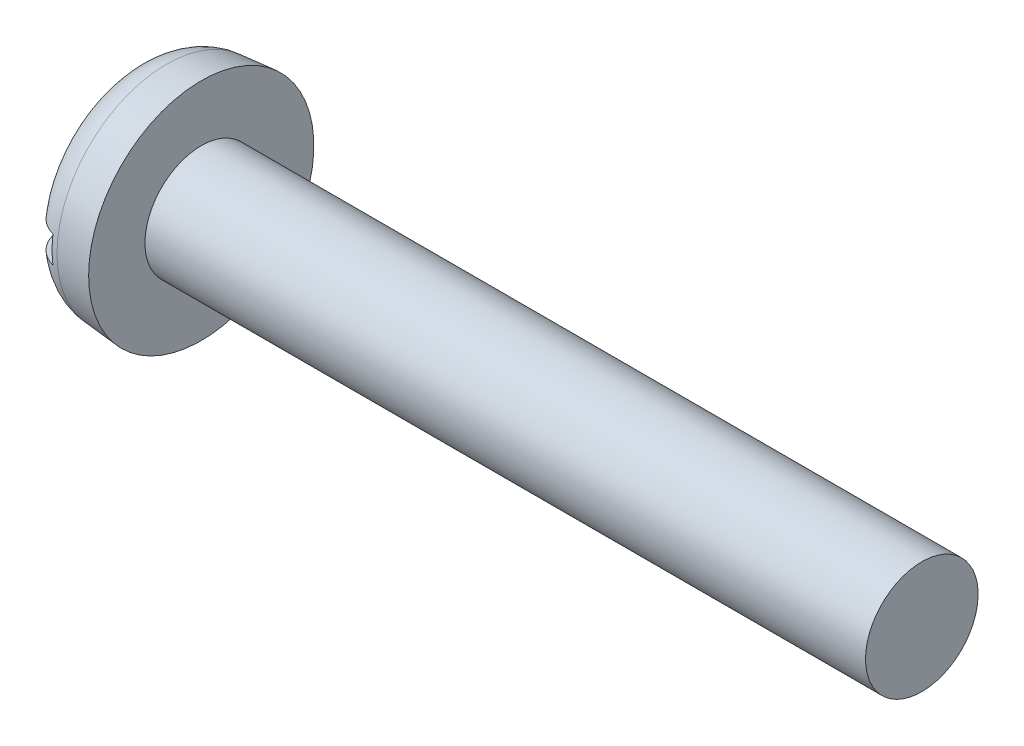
ISO-10303-21;
HEADER;
FILE_DESCRIPTION(('STEP AP214'),'2;1');
FILE_NAME('part.step','',(''),(''),'','','');
FILE_SCHEMA(('AUTOMOTIVE_DESIGN { 1 0 10303 214 1 1 1 1 }'));
ENDSEC;
DATA;
#1=APPLICATION_CONTEXT('core data for automotive mechanical design processes');
#2=APPLICATION_PROTOCOL_DEFINITION('international standard','automotive_design',2000,#1);
#3=PRODUCT_CONTEXT('',#1,'mechanical');
#4=PRODUCT('Part','Part','',(#3));
#5=PRODUCT_RELATED_PRODUCT_CATEGORY('part','',(#4));
#6=PRODUCT_DEFINITION_FORMATION('','',#4);
#7=PRODUCT_DEFINITION_CONTEXT('part definition',#1,'design');
#8=PRODUCT_DEFINITION('design','',#6,#7);
#9=PRODUCT_DEFINITION_SHAPE('','',#8);
#10=(LENGTH_UNIT() NAMED_UNIT(*) SI_UNIT(.MILLI.,.METRE.));
#11=(NAMED_UNIT(*) PLANE_ANGLE_UNIT() SI_UNIT($,.RADIAN.));
#12=(NAMED_UNIT(*) SI_UNIT($,.STERADIAN.) SOLID_ANGLE_UNIT());
#13=UNCERTAINTY_MEASURE_WITH_UNIT(LENGTH_MEASURE(1.E-05),#10,'distance_accuracy_value','');
#14=(GEOMETRIC_REPRESENTATION_CONTEXT(3) GLOBAL_UNCERTAINTY_ASSIGNED_CONTEXT((#13)) GLOBAL_UNIT_ASSIGNED_CONTEXT((#10,
#11,#12)) REPRESENTATION_CONTEXT('',''));
#15=CARTESIAN_POINT('',(0.,0.,0.));
#16=DIRECTION('',(0.,0.,1.));
#17=DIRECTION('',(1.,0.,0.));
#18=AXIS2_PLACEMENT_3D('',#15,#16,#17);
#19=CARTESIAN_POINT('',(0.,0.,0.));
#20=DIRECTION('',(-1.,0.,0.));
#21=DIRECTION('',(0.,0.,1.));
#22=AXIS2_PLACEMENT_3D('',#19,#20,#21);
#23=PLANE('',#22);
#24=DIRECTION('',(0.,0.,-1.));
#25=VECTOR('',#24,1.);
#26=CARTESIAN_POINT('',(0.,0.299999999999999,2.5));
#27=LINE('',#26,#25);
#28=CARTESIAN_POINT('',(0.,0.299999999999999,1.60795561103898));
#29=VERTEX_POINT('',#28);
#30=CARTESIAN_POINT('',(0.,0.299999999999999,-1.60795561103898));
#31=VERTEX_POINT('',#30);
#32=EDGE_CURVE('E86',#29,#31,#27,.T.);
#33=ORIENTED_EDGE('',*,*,#32,.F.);
#34=CARTESIAN_POINT('',(0.,0.,0.));
#35=DIRECTION('',(-1.,0.,0.));
#36=DIRECTION('',(0.,0.,1.));
#37=AXIS2_PLACEMENT_3D('',#34,#35,#36);
#38=CIRCLE('',#37,1.63570206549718);
#39=EDGE_CURVE('E92',#29,#31,#38,.T.);
#40=ORIENTED_EDGE('',*,*,#39,.T.);
#41=EDGE_LOOP('',(#33,#40));
#42=FACE_BOUND('',#41,.T.);
#43=ADVANCED_FACE('F33',(#42),#23,.T.);
#44=CARTESIAN_POINT('',(-25.4,0.,0.));
#45=DIRECTION('',(-1.,0.,0.));
#46=DIRECTION('',(0.,0.,1.));
#47=AXIS2_PLACEMENT_3D('',#44,#45,#46);
#48=CYLINDRICAL_SURFACE('',#47,1.25);
#49=CARTESIAN_POINT('',(17.5,0.,0.));
#50=DIRECTION('',(-1.,0.,0.));
#51=DIRECTION('',(0.,0.,1.));
#52=AXIS2_PLACEMENT_3D('',#49,#50,#51);
#53=CIRCLE('',#52,1.25);
#54=CARTESIAN_POINT('',(17.5,0.,1.25));
#55=VERTEX_POINT('',#54);
#56=EDGE_CURVE('E93',#55,#55,#53,.T.);
#57=ORIENTED_EDGE('',*,*,#56,.T.);
#58=EDGE_LOOP('',(#57));
#59=FACE_BOUND('',#58,.T.);
#60=CARTESIAN_POINT('',(1.5,0.,0.));
#61=DIRECTION('',(-1.,0.,0.));
#62=DIRECTION('',(0.,0.,1.));
#63=AXIS2_PLACEMENT_3D('',#60,#61,#62);
#64=CIRCLE('',#63,1.25);
#65=CARTESIAN_POINT('',(1.5,0.,1.25));
#66=VERTEX_POINT('',#65);
#67=EDGE_CURVE('E150',#66,#66,#64,.T.);
#68=ORIENTED_EDGE('',*,*,#67,.F.);
#69=EDGE_LOOP('',(#68));
#70=FACE_BOUND('',#69,.T.);
#71=ADVANCED_FACE('F138',(#59,#70),#48,.T.);
#72=CARTESIAN_POINT('',(17.5,1.25,0.));
#73=DIRECTION('',(1.,0.,0.));
#74=DIRECTION('',(0.,0.,-1.));
#75=AXIS2_PLACEMENT_3D('',#72,#73,#74);
#76=PLANE('',#75);
#77=ORIENTED_EDGE('',*,*,#56,.F.);
#78=EDGE_LOOP('',(#77));
#79=FACE_BOUND('',#78,.T.);
#80=ADVANCED_FACE('F136',(#79),#76,.T.);
#81=DIRECTION('',(0.,0.,1.));
#82=VECTOR('',#81,1.);
#83=CARTESIAN_POINT('',(0.,-0.299999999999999,-2.5));
#84=LINE('',#83,#82);
#85=CARTESIAN_POINT('',(0.,-0.3,-1.60795561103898));
#86=VERTEX_POINT('',#85);
#87=CARTESIAN_POINT('',(0.,-0.3,1.60795561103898));
#88=VERTEX_POINT('',#87);
#89=EDGE_CURVE('E77',#86,#88,#84,.T.);
#90=ORIENTED_EDGE('',*,*,#89,.F.);
#91=EDGE_CURVE('E84',#86,#88,#38,.T.);
#92=ORIENTED_EDGE('',*,*,#91,.T.);
#93=EDGE_LOOP('',(#90,#92));
#94=FACE_BOUND('',#93,.T.);
#95=ADVANCED_FACE('F83',(#94),#23,.T.);
#96=CARTESIAN_POINT('',(0.,0.,0.));
#97=DIRECTION('',(1.,0.,0.));
#98=DIRECTION('',(0.,0.,-1.));
#99=AXIS2_PLACEMENT_3D('',#96,#97,#98);
#100=CONICAL_SURFACE('',#99,2.36876700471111,0.0872664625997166);
#101=CARTESIAN_POINT('',(0.730275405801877,0.,0.));
#102=DIRECTION('',(-1.,0.,0.));
#103=DIRECTION('',(0.,0.,1.));
#104=AXIS2_PLACEMENT_3D('',#101,#102,#103);
#105=CIRCLE('',#104,2.43265782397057);
#106=CARTESIAN_POINT('',(0.730275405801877,0.,2.43265782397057));
#107=VERTEX_POINT('',#106);
#108=EDGE_CURVE('E96',#107,#107,#105,.F.);
#109=ORIENTED_EDGE('',*,*,#108,.T.);
#110=EDGE_LOOP('',(#109));
#111=FACE_BOUND('',#110,.T.);
#112=CARTESIAN_POINT('',(1.5,0.,0.));
#113=DIRECTION('',(-1.,0.,0.));
#114=DIRECTION('',(0.,0.,1.));
#115=AXIS2_PLACEMENT_3D('',#112,#113,#114);
#116=CIRCLE('',#115,2.5);
#117=CARTESIAN_POINT('',(1.5,0.,2.5));
#118=VERTEX_POINT('',#117);
#119=EDGE_CURVE('E98',#118,#118,#116,.T.);
#120=ORIENTED_EDGE('',*,*,#119,.T.);
#121=EDGE_LOOP('',(#120));
#122=FACE_BOUND('',#121,.T.);
#123=ADVANCED_FACE('F129',(#111,#122),#100,.T.);
#124=CARTESIAN_POINT('',(1.5,1.25,0.));
#125=DIRECTION('',(-1.,0.,0.));
#126=DIRECTION('',(0.,0.,1.));
#127=AXIS2_PLACEMENT_3D('',#124,#125,#126);
#128=PLANE('',#127);
#129=ORIENTED_EDGE('',*,*,#119,.F.);
#130=EDGE_LOOP('',(#129));
#131=FACE_BOUND('',#130,.T.);
#132=ORIENTED_EDGE('',*,*,#67,.T.);
#133=EDGE_LOOP('',(#132));
#134=FACE_BOUND('',#133,.T.);
#135=ADVANCED_FACE('F125',(#131,#134),#128,.F.);
#136=CARTESIAN_POINT('',(0.8,0.,0.));
#137=DIRECTION('',(-1.,0.,0.));
#138=DIRECTION('',(0.,0.,1.));
#139=AXIS2_PLACEMENT_3D('',#136,#137,#138);
#140=TOROIDAL_SURFACE('',#139,1.63570206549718,0.8);
#141=CARTESIAN_POINT('',(0.241553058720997,0.299999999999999,-2.18806414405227));
#142=CARTESIAN_POINT('',(0.273486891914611,0.299999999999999,-2.219484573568));
#143=CARTESIAN_POINT('',(0.308083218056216,0.299999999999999,-2.2482435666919));
#144=CARTESIAN_POINT('',(0.381637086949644,0.299999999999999,-2.2995751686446));
#145=CARTESIAN_POINT('',(0.420599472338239,0.299999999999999,-2.32214081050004));
#146=CARTESIAN_POINT('',(0.501759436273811,0.299999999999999,-2.360393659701));
#147=CARTESIAN_POINT('',(0.543956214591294,0.299999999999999,-2.37608256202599));
#148=CARTESIAN_POINT('',(0.630379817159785,0.299999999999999,-2.40012145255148));
#149=CARTESIAN_POINT('',(0.674606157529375,0.299999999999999,-2.40847318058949));
#150=CARTESIAN_POINT('',(0.763687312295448,0.299999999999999,-2.41758391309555));
#151=CARTESIAN_POINT('',(0.808539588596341,0.299999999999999,-2.41836773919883));
#152=CARTESIAN_POINT('',(0.897738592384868,0.299999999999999,-2.41238411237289));
#153=CARTESIAN_POINT('',(0.942085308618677,0.299999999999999,-2.40561649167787));
#154=CARTESIAN_POINT('',(1.02895845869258,0.299999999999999,-2.38474089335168));
#155=CARTESIAN_POINT('',(1.07148703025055,0.299999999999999,-2.37064180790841));
#156=CARTESIAN_POINT('',(1.15358098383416,0.299999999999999,-2.33551973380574));
#157=CARTESIAN_POINT('',(1.19314635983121,0.299999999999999,-2.31449673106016));
#158=CARTESIAN_POINT('',(1.26829517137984,0.299999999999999,-2.26608024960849));
#159=CARTESIAN_POINT('',(1.30386914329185,0.299999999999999,-2.23867208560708));
#160=CARTESIAN_POINT('',(1.36994420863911,0.299999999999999,-2.17830511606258));
#161=CARTESIAN_POINT('',(1.40044520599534,0.299999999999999,-2.14534620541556));
#162=CARTESIAN_POINT('',(1.45571441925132,0.299999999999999,-2.07460780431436));
#163=CARTESIAN_POINT('',(1.48044693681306,0.299999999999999,-2.03680042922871));
#164=CARTESIAN_POINT('',(1.5232858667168,0.299999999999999,-1.95760333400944));
#165=CARTESIAN_POINT('',(1.54139201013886,0.299999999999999,-1.9162134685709));
#166=CARTESIAN_POINT('',(1.57067208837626,0.299999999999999,-1.83058118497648));
#167=CARTESIAN_POINT('',(1.58177374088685,0.299999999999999,-1.7863140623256));
#168=CARTESIAN_POINT('',(1.59650148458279,0.299999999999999,-1.69655495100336));
#169=CARTESIAN_POINT('',(1.60012708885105,0.299999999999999,-1.65106288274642));
#170=CARTESIAN_POINT('',(1.59986422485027,0.299999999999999,-1.55944552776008));
#171=CARTESIAN_POINT('',(1.59586670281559,0.299999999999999,-1.51332056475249));
#172=CARTESIAN_POINT('',(1.58031748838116,0.299999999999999,-1.42236288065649));
#173=CARTESIAN_POINT('',(1.56876510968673,0.299999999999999,-1.37753027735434));
#174=CARTESIAN_POINT('',(1.53821798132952,0.299999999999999,-1.28962965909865));
#175=CARTESIAN_POINT('',(1.51910141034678,0.299999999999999,-1.24660396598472));
#176=CARTESIAN_POINT('',(1.4739944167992,0.299999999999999,-1.16431539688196));
#177=CARTESIAN_POINT('',(1.44800306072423,0.299999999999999,-1.12505303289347));
#178=CARTESIAN_POINT('',(1.38953237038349,0.299999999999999,-1.0509944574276));
#179=CARTESIAN_POINT('',(1.35698561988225,0.299999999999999,-1.01625139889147));
#180=CARTESIAN_POINT('',(1.28643964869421,0.299999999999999,-0.952810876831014));
#181=CARTESIAN_POINT('',(1.24844019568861,0.299999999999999,-0.924113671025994));
#182=CARTESIAN_POINT('',(1.16862359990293,0.299999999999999,-0.874188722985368));
#183=CARTESIAN_POINT('',(1.12687482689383,0.299999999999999,-0.852852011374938));
#184=CARTESIAN_POINT('',(1.04024465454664,0.299999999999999,-0.817966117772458));
#185=CARTESIAN_POINT('',(0.995364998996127,0.299999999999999,-0.804412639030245));
#186=CARTESIAN_POINT('',(0.906428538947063,0.299999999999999,-0.786315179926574));
#187=CARTESIAN_POINT('',(0.862465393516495,0.299999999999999,-0.781310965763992));
#188=CARTESIAN_POINT('',(0.774351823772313,0.299999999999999,-0.779140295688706));
#189=CARTESIAN_POINT('',(0.730201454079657,0.299999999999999,-0.78197169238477));
#190=CARTESIAN_POINT('',(0.645014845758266,0.299999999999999,-0.795014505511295));
#191=CARTESIAN_POINT('',(0.603927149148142,0.299999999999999,-0.804894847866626));
#192=CARTESIAN_POINT('',(0.523912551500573,0.299999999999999,-0.831215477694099));
#193=CARTESIAN_POINT('',(0.484986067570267,0.299999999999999,-0.847657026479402));
#194=CARTESIAN_POINT('',(0.409119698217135,0.299999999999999,-0.887046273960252));
#195=CARTESIAN_POINT('',(0.372272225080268,0.299999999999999,-0.910171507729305));
#196=CARTESIAN_POINT('',(0.302689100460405,0.299999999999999,-0.961944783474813));
#197=CARTESIAN_POINT('',(0.269954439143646,0.299999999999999,-0.990594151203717));
#198=CARTESIAN_POINT('',(0.207500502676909,0.299999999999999,-1.0544791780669));
#199=CARTESIAN_POINT('',(0.178079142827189,0.299999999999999,-1.09000648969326));
#200=CARTESIAN_POINT('',(0.125406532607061,0.299999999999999,-1.16537577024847));
#201=CARTESIAN_POINT('',(0.102156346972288,0.299999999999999,-1.20521848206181));
#202=CARTESIAN_POINT('',(0.0618533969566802,0.299999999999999,-1.28940055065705));
#203=CARTESIAN_POINT('',(0.0450063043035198,0.299999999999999,-1.33383862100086));
#204=CARTESIAN_POINT('',(0.0190387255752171,0.299999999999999,-1.42491821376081));
#205=CARTESIAN_POINT('',(0.00991800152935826,0.299999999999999,-1.47155966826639));
#206=CARTESIAN_POINT('',(-0.000253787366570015,0.299999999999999,-1.56555416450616));
#207=CARTESIAN_POINT('',(-0.00133269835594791,0.299999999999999,-1.61290418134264));
#208=CARTESIAN_POINT('',(0.00461213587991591,0.299999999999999,-1.70710757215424));
#209=CARTESIAN_POINT('',(0.0116373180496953,0.299999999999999,-1.7539608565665));
#210=CARTESIAN_POINT('',(0.0334759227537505,0.299999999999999,-1.84503548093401));
#211=CARTESIAN_POINT('',(0.0481656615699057,0.299999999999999,-1.88928654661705));
#212=CARTESIAN_POINT('',(0.0848786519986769,0.299999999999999,-1.97459063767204));
#213=CARTESIAN_POINT('',(0.106892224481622,0.299999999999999,-2.01564779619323));
#214=CARTESIAN_POINT('',(0.148004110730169,0.299999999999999,-2.07862726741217));
#215=CARTESIAN_POINT('',(0.165054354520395,0.299999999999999,-2.10191210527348));
#216=CARTESIAN_POINT('',(0.201553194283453,0.299999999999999,-2.14652009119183));
#217=CARTESIAN_POINT('',(0.221001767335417,0.299999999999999,-2.16784325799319));
#218=CARTESIAN_POINT('',(0.241553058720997,0.299999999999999,-2.18806414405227));
#219=B_SPLINE_CURVE_WITH_KNOTS('',3,(#141,#142,#143,#144,#145,#146,#147,#148,#149,#150,#151,
#152,#153,#154,#155,#156,#157,#158,#159,#160,#161,#162,#163,#164,#165,#166,#167,#168,#169,#170,
#171,#172,#173,#174,#175,#176,#177,#178,#179,#180,#181,#182,#183,#184,#185,#186,#187,#188,#189,
#190,#191,#192,#193,#194,#195,#196,#197,#198,#199,#200,#201,#202,#203,#204,#205,#206,#207,#208,
#209,#210,#211,#212,#213,#214,#215,#216,#217,#218),.UNSPECIFIED.,.T.,.F.,(4,2,2,2,2,2,2,2,2,2,2,
2,2,2,2,2,2,2,2,2,2,2,2,2,2,2,2,2,2,2,2,2,2,2,2,2,2,2,4),(0.,0.134294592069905,
0.268739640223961,0.403151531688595,0.53753154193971,0.671470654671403,0.805412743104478,
0.939192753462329,1.07297303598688,1.20706409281,1.34115768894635,1.4760603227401,
1.610968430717,1.74724687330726,1.88353419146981,2.02178582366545,2.16005001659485,
2.3006380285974,2.44124514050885,2.58337977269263,2.72552046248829,2.86545608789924,
3.0053143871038,3.13737410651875,3.26939763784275,3.39559705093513,3.5218207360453,
3.6517660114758,3.78174251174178,3.91950163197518,4.05728450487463,4.19917951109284,
4.34107014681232,4.48246923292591,4.62389339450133,4.76310290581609,4.90212916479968,
4.98855642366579,5.07498285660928),.UNSPECIFIED.);
#220=CARTESIAN_POINT('',(0.6,0.299999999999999,-2.39155597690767));
#221=VERTEX_POINT('',#220);
#222=EDGE_CURVE('E11',#31,#221,#219,.T.);
#223=ORIENTED_EDGE('',*,*,#222,.F.);
#224=ORIENTED_EDGE('',*,*,#39,.F.);
#225=CARTESIAN_POINT('',(0.325582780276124,0.299999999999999,0.945080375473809));
#226=CARTESIAN_POINT('',(0.360465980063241,0.299999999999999,0.918126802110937));
#227=CARTESIAN_POINT('',(0.39753706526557,0.299999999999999,0.89396794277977));
#228=CARTESIAN_POINT('',(0.475178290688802,0.299999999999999,0.852069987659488));
#229=CARTESIAN_POINT('',(0.515750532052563,0.299999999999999,0.834334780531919));
#230=CARTESIAN_POINT('',(0.599430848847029,0.299999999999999,0.806000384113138));
#231=CARTESIAN_POINT('',(0.642544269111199,0.299999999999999,0.795416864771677));
#232=CARTESIAN_POINT('',(0.729949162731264,0.299999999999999,0.781986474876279));
#233=CARTESIAN_POINT('',(0.774240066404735,0.299999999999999,0.779135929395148));
#234=CARTESIAN_POINT('',(0.860900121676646,0.299999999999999,0.781273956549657));
#235=CARTESIAN_POINT('',(0.903277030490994,0.299999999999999,0.785962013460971));
#236=CARTESIAN_POINT('',(0.98664237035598,0.299999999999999,0.802380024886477));
#237=CARTESIAN_POINT('',(1.02763059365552,0.299999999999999,0.814111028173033));
#238=CARTESIAN_POINT('',(1.10721823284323,0.299999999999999,0.844123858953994));
#239=CARTESIAN_POINT('',(1.1458124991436,0.299999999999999,0.862419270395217));
#240=CARTESIAN_POINT('',(1.21961995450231,0.299999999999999,0.904880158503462));
#241=CARTESIAN_POINT('',(1.25483237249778,0.299999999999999,0.929046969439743));
#242=CARTESIAN_POINT('',(1.32303560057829,0.299999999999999,0.984072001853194));
#243=CARTESIAN_POINT('',(1.35577888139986,0.299999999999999,1.01523716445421));
#244=CARTESIAN_POINT('',(1.41584692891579,0.299999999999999,1.08241378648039));
#245=CARTESIAN_POINT('',(1.44317052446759,0.299999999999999,1.11842629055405));
#246=CARTESIAN_POINT('',(1.49280325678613,0.299999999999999,1.19602852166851));
#247=CARTESIAN_POINT('',(1.51483781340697,0.299999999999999,1.23779426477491));
#248=CARTESIAN_POINT('',(1.55163905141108,0.299999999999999,1.32441622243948));
#249=CARTESIAN_POINT('',(1.5664052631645,0.299999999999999,1.36927263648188));
#250=CARTESIAN_POINT('',(1.58827918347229,0.299999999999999,1.46113964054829));
#251=CARTESIAN_POINT('',(1.59533472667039,0.299999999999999,1.50816268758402));
#252=CARTESIAN_POINT('',(1.6013346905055,0.299999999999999,1.60272526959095));
#253=CARTESIAN_POINT('',(1.60027956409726,0.299999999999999,1.65026477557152));
#254=CARTESIAN_POINT('',(1.59008797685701,0.299999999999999,1.74381783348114));
#255=CARTESIAN_POINT('',(1.58106139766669,0.299999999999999,1.78984333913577));
#256=CARTESIAN_POINT('',(1.55527524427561,0.299999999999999,1.87967577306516));
#257=CARTESIAN_POINT('',(1.53851634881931,0.299999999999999,1.92348289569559));
#258=CARTESIAN_POINT('',(1.49805220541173,0.299999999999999,2.00685269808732));
#259=CARTESIAN_POINT('',(1.47446834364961,0.299999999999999,2.04647430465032));
#260=CARTESIAN_POINT('',(1.42089792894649,0.299999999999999,2.1211234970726));
#261=CARTESIAN_POINT('',(1.3909118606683,0.299999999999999,2.15615143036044));
#262=CARTESIAN_POINT('',(1.32582862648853,0.299999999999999,2.2201279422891));
#263=CARTESIAN_POINT('',(1.29080536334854,0.299999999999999,2.24915172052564));
#264=CARTESIAN_POINT('',(1.21634648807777,0.299999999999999,2.30084404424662));
#265=CARTESIAN_POINT('',(1.17691110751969,0.299999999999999,2.32351292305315));
#266=CARTESIAN_POINT('',(1.09512866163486,0.299999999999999,2.36164850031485));
#267=CARTESIAN_POINT('',(1.05281068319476,0.299999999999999,2.3771775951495));
#268=CARTESIAN_POINT('',(0.96616121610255,0.299999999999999,2.40087211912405));
#269=CARTESIAN_POINT('',(0.921829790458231,0.299999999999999,2.40903777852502));
#270=CARTESIAN_POINT('',(0.832640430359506,0.299999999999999,2.41774335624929));
#271=CARTESIAN_POINT('',(0.787786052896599,0.299999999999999,2.41831975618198));
#272=CARTESIAN_POINT('',(0.698619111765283,0.299999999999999,2.41192430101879));
#273=CARTESIAN_POINT('',(0.654306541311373,0.299999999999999,2.40495254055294));
#274=CARTESIAN_POINT('',(0.567532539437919,0.299999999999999,2.38367749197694));
#275=CARTESIAN_POINT('',(0.525069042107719,0.299999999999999,2.36938262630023));
#276=CARTESIAN_POINT('',(0.443136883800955,0.299999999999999,2.33388299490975));
#277=CARTESIAN_POINT('',(0.403668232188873,0.299999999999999,2.31267820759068));
#278=CARTESIAN_POINT('',(0.328740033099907,0.299999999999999,2.26391578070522));
#279=CARTESIAN_POINT('',(0.293290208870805,0.299999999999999,2.2363432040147));
#280=CARTESIAN_POINT('',(0.227488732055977,0.299999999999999,2.17567064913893));
#281=CARTESIAN_POINT('',(0.197137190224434,0.299999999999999,2.14257055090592));
#282=CARTESIAN_POINT('',(0.142187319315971,0.299999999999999,2.07157434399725));
#283=CARTESIAN_POINT('',(0.117625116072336,0.299999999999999,2.03365028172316));
#284=CARTESIAN_POINT('',(0.075143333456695,0.299999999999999,1.95424980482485));
#285=CARTESIAN_POINT('',(0.05722404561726,0.299999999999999,1.91277323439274));
#286=CARTESIAN_POINT('',(0.0283296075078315,0.299999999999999,1.82699572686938));
#287=CARTESIAN_POINT('',(0.0174274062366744,0.299999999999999,1.78267022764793));
#288=CARTESIAN_POINT('',(0.00310551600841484,0.299999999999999,1.69282988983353));
#289=CARTESIAN_POINT('',(-0.000313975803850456,0.299999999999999,1.64731501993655));
#290=CARTESIAN_POINT('',(0.00036415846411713,0.299999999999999,1.55568808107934));
#291=CARTESIAN_POINT('',(0.00457053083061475,0.299999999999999,1.50957683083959));
#292=CARTESIAN_POINT('',(0.0205339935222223,0.299999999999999,1.41866966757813));
#293=CARTESIAN_POINT('',(0.0322934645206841,0.299999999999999,1.37387417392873));
#294=CARTESIAN_POINT('',(0.0632540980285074,0.299999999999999,1.2860673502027));
#295=CARTESIAN_POINT('',(0.0825799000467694,0.299999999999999,1.24310001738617));
#296=CARTESIAN_POINT('',(0.128084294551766,0.299999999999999,1.16099749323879));
#297=CARTESIAN_POINT('',(0.154256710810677,0.299999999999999,1.12185889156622));
#298=CARTESIAN_POINT('',(0.204267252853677,0.299999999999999,1.05910852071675));
#299=CARTESIAN_POINT('',(0.226595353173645,0.299999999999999,1.03427766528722));
#300=CARTESIAN_POINT('',(0.274059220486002,0.299999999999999,0.987458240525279));
#301=CARTESIAN_POINT('',(0.299195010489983,0.299999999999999,0.965469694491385));
#302=CARTESIAN_POINT('',(0.325582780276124,0.299999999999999,0.945080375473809));
#303=B_SPLINE_CURVE_WITH_KNOTS('',3,(#225,#226,#227,#228,#229,#230,#231,#232,#233,#234,#235,
#236,#237,#238,#239,#240,#241,#242,#243,#244,#245,#246,#247,#248,#249,#250,#251,#252,#253,#254,
#255,#256,#257,#258,#259,#260,#261,#262,#263,#264,#265,#266,#267,#268,#269,#270,#271,#272,#273,
#274,#275,#276,#277,#278,#279,#280,#281,#282,#283,#284,#285,#286,#287,#288,#289,#290,#291,#292,
#293,#294,#295,#296,#297,#298,#299,#300,#301,#302),.UNSPECIFIED.,.T.,.F.,(4,2,2,2,2,2,2,2,2,2,2,
2,2,2,2,2,2,2,2,2,2,2,2,2,2,2,2,2,2,2,2,2,2,2,2,2,2,2,4),(0.,0.132137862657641,
0.264355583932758,0.396862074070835,0.529305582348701,0.656598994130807,0.783911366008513,
0.911488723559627,1.03909510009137,1.17410712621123,1.30914829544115,1.45015029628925,
1.59116140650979,1.73312071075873,1.87507208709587,2.01509676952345,2.15510916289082,
2.29277014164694,2.43042070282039,2.56622605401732,2.70202428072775,2.83661205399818,
2.97119561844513,3.10513200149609,3.23906670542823,3.37284771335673,3.50662913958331,
3.64072762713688,3.77482902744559,3.90974629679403,4.04466948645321,4.18097358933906,
4.31728128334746,4.45554806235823,4.59385844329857,4.73455014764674,4.87511537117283,
4.97507165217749,5.07502875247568),.UNSPECIFIED.);
#304=CARTESIAN_POINT('',(0.6,0.299999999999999,2.39155597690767));
#305=VERTEX_POINT('',#304);
#306=EDGE_CURVE('E110',#305,#29,#303,.T.);
#307=ORIENTED_EDGE('',*,*,#306,.F.);
#308=CARTESIAN_POINT('',(0.6,0.,0.));
#309=DIRECTION('',(-1.,0.,0.));
#310=DIRECTION('',(0.,0.,1.));
#311=AXIS2_PLACEMENT_3D('',#308,#309,#310);
#312=CIRCLE('',#311,2.41029873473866);
#313=CARTESIAN_POINT('',(0.6,-0.3,2.39155597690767));
#314=VERTEX_POINT('',#313);
#315=EDGE_CURVE('E104',#305,#314,#312,.F.);
#316=ORIENTED_EDGE('',*,*,#315,.T.);
#317=CARTESIAN_POINT('',(0.325582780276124,-0.3,0.945080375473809));
#318=CARTESIAN_POINT('',(0.288319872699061,-0.3,0.973876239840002));
#319=CARTESIAN_POINT('',(0.253501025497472,-0.3,1.00590457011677));
#320=CARTESIAN_POINT('',(0.189696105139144,-0.3,1.07538681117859));
#321=CARTESIAN_POINT('',(0.160720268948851,-0.3,1.11285004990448));
#322=CARTESIAN_POINT('',(0.109449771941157,-0.3,1.19204724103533));
#323=CARTESIAN_POINT('',(0.0871478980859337,-0.3,1.23377651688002));
#324=CARTESIAN_POINT('',(0.0498324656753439,-0.3,1.32035492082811));
#325=CARTESIAN_POINT('',(0.0348158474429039,-0.3,1.36520273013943));
#326=CARTESIAN_POINT('',(0.0124672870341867,-0.3,1.45703060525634));
#327=CARTESIAN_POINT('',(0.00517650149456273,-0.3,1.5040207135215));
#328=CARTESIAN_POINT('',(-0.00129803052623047,-0.3,1.59856214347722));
#329=CARTESIAN_POINT('',(-0.000481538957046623,-0.3,1.64611348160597));
#330=CARTESIAN_POINT('',(0.00924123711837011,-0.3,1.73973571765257));
#331=CARTESIAN_POINT('',(0.0180384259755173,-0.3,1.78581792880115));
#332=CARTESIAN_POINT('',(0.0433789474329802,-0.3,1.87580166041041));
#333=CARTESIAN_POINT('',(0.0599215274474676,-0.3,1.91970339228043));
#334=CARTESIAN_POINT('',(0.0999760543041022,-0.3,2.00329545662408));
#335=CARTESIAN_POINT('',(0.123366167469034,-0.3,2.04304417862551));
#336=CARTESIAN_POINT('',(0.17657394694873,-0.3,2.11797834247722));
#337=CARTESIAN_POINT('',(0.206391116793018,-0.3,2.15316413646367));
#338=CARTESIAN_POINT('',(0.271166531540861,-0.3,2.21747794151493));
#339=CARTESIAN_POINT('',(0.306050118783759,-0.3,2.24668116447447));
#340=CARTESIAN_POINT('',(0.380262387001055,-0.3,2.29875303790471));
#341=CARTESIAN_POINT('',(0.419590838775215,-0.3,2.32162201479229));
#342=CARTESIAN_POINT('',(0.50119340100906,-0.3,2.36016923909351));
#343=CARTESIAN_POINT('',(0.543437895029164,-0.3,2.37591020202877));
#344=CARTESIAN_POINT('',(0.62997726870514,-0.3,2.40003737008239));
#345=CARTESIAN_POINT('',(0.674272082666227,-0.3,2.40842381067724));
#346=CARTESIAN_POINT('',(0.763423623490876,-0.3,2.41757198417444));
#347=CARTESIAN_POINT('',(0.80827656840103,-0.3,2.41837061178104));
#348=CARTESIAN_POINT('',(0.897477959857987,-0.3,2.412416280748));
#349=CARTESIAN_POINT('',(0.941826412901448,-0.3,2.4056634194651));
#350=CARTESIAN_POINT('',(1.02870592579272,-0.3,2.38481675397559));
#351=CARTESIAN_POINT('',(1.07123910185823,-0.3,2.3707317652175));
#352=CARTESIAN_POINT('',(1.15334462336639,-0.3,2.33563687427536));
#353=CARTESIAN_POINT('',(1.19291695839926,-0.3,2.3146269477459));
#354=CARTESIAN_POINT('',(1.26808156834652,-0.3,2.26623538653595));
#355=CARTESIAN_POINT('',(1.30366440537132,-0.3,2.23883909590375));
#356=CARTESIAN_POINT('',(1.36975910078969,-0.3,2.17849415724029));
#357=CARTESIAN_POINT('',(1.40027085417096,-0.3,2.14554539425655));
#358=CARTESIAN_POINT('',(1.45556302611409,-0.3,2.07482553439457));
#359=CARTESIAN_POINT('',(1.48030778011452,-0.3,2.0370265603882));
#360=CARTESIAN_POINT('',(1.52317234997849,-0.3,1.95784414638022));
#361=CARTESIAN_POINT('',(1.54129190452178,-0.3,1.91646056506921));
#362=CARTESIAN_POINT('',(1.570599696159,-0.3,1.8308387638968));
#363=CARTESIAN_POINT('',(1.58171568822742,-0.3,1.7865758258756));
#364=CARTESIAN_POINT('',(1.59647258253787,-0.3,1.69682261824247));
#365=CARTESIAN_POINT('',(1.60011299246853,-0.3,1.65133226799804));
#366=CARTESIAN_POINT('',(1.59987999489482,-0.3,1.55971607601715));
#367=CARTESIAN_POINT('',(1.59589756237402,-0.3,1.51359052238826));
#368=CARTESIAN_POINT('',(1.58037822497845,-0.3,1.4226292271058));
#369=CARTESIAN_POINT('',(1.56884064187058,-0.3,1.37779360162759));
#370=CARTESIAN_POINT('',(1.53832268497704,-0.3,1.28988447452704));
#371=CARTESIAN_POINT('',(1.51922047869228,-0.3,1.24685325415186));
#372=CARTESIAN_POINT('',(1.47414116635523,-0.3,1.1645512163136));
#373=CARTESIAN_POINT('',(1.44816311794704,-0.3,1.12528091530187));
#374=CARTESIAN_POINT('',(1.38971753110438,-0.3,1.05120370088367));
#375=CARTESIAN_POINT('',(1.35718249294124,-0.3,1.01644997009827));
#376=CARTESIAN_POINT('',(1.28665802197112,-0.3,0.952985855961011));
#377=CARTESIAN_POINT('',(1.24866833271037,-0.3,0.924275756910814));
#378=CARTESIAN_POINT('',(1.16886658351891,-0.3,0.874321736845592));
#379=CARTESIAN_POINT('',(1.12712266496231,-0.3,0.852969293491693));
#380=CARTESIAN_POINT('',(1.04050129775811,-0.3,0.81805212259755));
#381=CARTESIAN_POINT('',(0.995625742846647,-0.3,0.804482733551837));
#382=CARTESIAN_POINT('',(0.906698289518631,-0.3,0.786354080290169));
#383=CARTESIAN_POINT('',(0.862740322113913,-0.3,0.781334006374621));
#384=CARTESIAN_POINT('',(0.77462108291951,-0.3,0.779130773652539));
#385=CARTESIAN_POINT('',(0.73045981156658,-0.3,0.781947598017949));
#386=CARTESIAN_POINT('',(0.645236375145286,-0.3,0.794965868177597));
#387=CARTESIAN_POINT('',(0.604123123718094,-0.3,0.804839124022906));
#388=CARTESIAN_POINT('',(0.524093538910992,-0.3,0.831147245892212));
#389=CARTESIAN_POINT('',(0.485174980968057,-0.3,0.847575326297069));
#390=CARTESIAN_POINT('',(0.426325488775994,-0.3,0.878103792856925));
#391=CARTESIAN_POINT('',(0.40534570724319,-0.3,0.890233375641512));
#392=CARTESIAN_POINT('',(0.364556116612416,-0.3,0.916317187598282));
#393=CARTESIAN_POINT('',(0.344746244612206,-0.3,0.930271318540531));
#394=CARTESIAN_POINT('',(0.325582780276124,-0.3,0.945080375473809));
#395=B_SPLINE_CURVE_WITH_KNOTS('',3,(#317,#318,#319,#320,#321,#322,#323,#324,#325,#326,#327,
#328,#329,#330,#331,#332,#333,#334,#335,#336,#337,#338,#339,#340,#341,#342,#343,#344,#345,#346,
#347,#348,#349,#350,#351,#352,#353,#354,#355,#356,#357,#358,#359,#360,#361,#362,#363,#364,#365,
#366,#367,#368,#369,#370,#371,#372,#373,#374,#375,#376,#377,#378,#379,#380,#381,#382,#383,#384,
#385,#386,#387,#388,#389,#390,#391,#392,#393,#394),.UNSPECIFIED.,.T.,.F.,(4,2,2,2,2,2,2,2,2,2,2,
2,2,2,2,2,2,2,2,2,2,2,2,2,2,2,2,2,2,2,2,2,2,2,2,2,2,2,4),(0.,0.141187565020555,
0.282620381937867,0.423899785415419,0.565119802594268,0.707088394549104,0.849061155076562,
0.989121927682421,1.12916909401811,1.26686199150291,1.40454425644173,1.54037200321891,
1.67619274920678,1.81079408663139,1.94539111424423,2.07933334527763,2.21327384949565,
2.34705368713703,2.48083399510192,2.61492438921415,2.74901755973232,2.88391920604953,
3.01882617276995,3.1551029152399,3.29138863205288,3.4296381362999,3.5679000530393,
3.70848574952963,3.84909072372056,3.99122474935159,4.13336545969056,4.27330959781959,
4.41316983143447,4.54522036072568,4.67727060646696,4.80354847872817,4.92969596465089,
5.00230942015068,5.07491896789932),.UNSPECIFIED.);
#396=EDGE_CURVE('E91',#88,#314,#395,.T.);
#397=ORIENTED_EDGE('',*,*,#396,.F.);
#398=ORIENTED_EDGE('',*,*,#91,.F.);
#399=CARTESIAN_POINT('',(0.241553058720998,-0.3,-2.18806414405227));
#400=CARTESIAN_POINT('',(0.20919394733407,-0.3,-2.15621947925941));
#401=CARTESIAN_POINT('',(0.179521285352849,-0.3,-2.12159379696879));
#402=CARTESIAN_POINT('',(0.126408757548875,-0.3,-2.0478077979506));
#403=CARTESIAN_POINT('',(0.102977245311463,-0.3,-2.00864150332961));
#404=CARTESIAN_POINT('',(0.0630267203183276,-0.3,-1.92697599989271));
#405=CARTESIAN_POINT('',(0.0465007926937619,-0.3,-1.88448017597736));
#406=CARTESIAN_POINT('',(0.0207481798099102,-0.3,-1.79734823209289));
#407=CARTESIAN_POINT('',(0.0115196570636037,-0.3,-1.75271265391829));
#408=CARTESIAN_POINT('',(0.000494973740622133,-0.3,-1.66209112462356));
#409=CARTESIAN_POINT('',(-0.00122761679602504,-0.3,-1.61609623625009));
#410=CARTESIAN_POINT('',(0.00294230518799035,-0.3,-1.52445227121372));
#411=CARTESIAN_POINT('',(0.00883576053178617,-0.3,-1.47880323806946));
#412=CARTESIAN_POINT('',(0.0281740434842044,-0.3,-1.38835001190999));
#413=CARTESIAN_POINT('',(0.0417411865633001,-0.3,-1.34357197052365));
#414=CARTESIAN_POINT('',(0.0760891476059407,-0.3,-1.25687228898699));
#415=CARTESIAN_POINT('',(0.0968707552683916,-0.3,-1.21495096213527));
#416=CARTESIAN_POINT('',(0.145417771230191,-0.3,-1.13451591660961));
#417=CARTESIAN_POINT('',(0.173281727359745,-0.3,-1.0960616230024));
#418=CARTESIAN_POINT('',(0.23508474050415,-0.3,-1.02437648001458));
#419=CARTESIAN_POINT('',(0.269024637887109,-0.3,-0.991146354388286));
#420=CARTESIAN_POINT('',(0.341995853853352,-0.3,-0.931047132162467));
#421=CARTESIAN_POINT('',(0.381013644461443,-0.3,-0.904161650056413));
#422=CARTESIAN_POINT('',(0.463164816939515,-0.3,-0.857652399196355));
#423=CARTESIAN_POINT('',(0.506296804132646,-0.3,-0.838026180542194));
#424=CARTESIAN_POINT('',(0.593534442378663,-0.3,-0.807594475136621));
#425=CARTESIAN_POINT('',(0.637521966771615,-0.3,-0.796451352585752));
#426=CARTESIAN_POINT('',(0.726774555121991,-0.3,-0.78223490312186));
#427=CARTESIAN_POINT('',(0.77203895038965,-0.3,-0.779157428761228));
#428=CARTESIAN_POINT('',(0.859707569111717,-0.3,-0.781175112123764));
#429=CARTESIAN_POINT('',(0.902123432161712,-0.3,-0.785800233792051));
#430=CARTESIAN_POINT('',(0.985573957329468,-0.3,-0.80210588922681));
#431=CARTESIAN_POINT('',(1.02660848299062,-0.3,-0.813787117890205));
#432=CARTESIAN_POINT('',(1.10625752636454,-0.3,-0.843701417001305));
#433=CARTESIAN_POINT('',(1.14486910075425,-0.3,-0.861942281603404));
#434=CARTESIAN_POINT('',(1.21871953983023,-0.3,-0.904297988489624));
#435=CARTESIAN_POINT('',(1.25395762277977,-0.3,-0.92841418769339));
#436=CARTESIAN_POINT('',(1.3222188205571,-0.3,-0.983337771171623));
#437=CARTESIAN_POINT('',(1.35499517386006,-0.3,-1.01445196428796));
#438=CARTESIAN_POINT('',(1.41513803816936,-0.3,-1.08153194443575));
#439=CARTESIAN_POINT('',(1.44250337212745,-0.3,-1.11749878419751));
#440=CARTESIAN_POINT('',(1.49223347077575,-0.3,-1.19501995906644));
#441=CARTESIAN_POINT('',(1.51432307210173,-0.3,-1.23675121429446));
#442=CARTESIAN_POINT('',(1.55124040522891,-0.3,-1.32331346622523));
#443=CARTESIAN_POINT('',(1.5660676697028,-0.3,-1.36814466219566));
#444=CARTESIAN_POINT('',(1.58807022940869,-0.3,-1.45997748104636));
#445=CARTESIAN_POINT('',(1.59519237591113,-0.3,-1.50699187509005));
#446=CARTESIAN_POINT('',(1.60132641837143,-0.3,-1.60154866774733));
#447=CARTESIAN_POINT('',(1.60033875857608,-0.3,-1.64909103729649));
#448=CARTESIAN_POINT('',(1.59027983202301,-0.3,-1.74266328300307));
#449=CARTESIAN_POINT('',(1.58131812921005,-0.3,-1.78870492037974));
#450=CARTESIAN_POINT('',(1.55565797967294,-0.3,-1.87858039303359));
#451=CARTESIAN_POINT('',(1.53896022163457,-0.3,-1.92241442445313));
#452=CARTESIAN_POINT('',(1.498611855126,-0.3,-2.00584729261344));
#453=CARTESIAN_POINT('',(1.4750827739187,-0.3,-2.04550491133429));
#454=CARTESIAN_POINT('',(1.42161482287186,-0.3,-2.12023491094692));
#455=CARTESIAN_POINT('',(1.39167642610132,-0.3,-2.15530762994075));
#456=CARTESIAN_POINT('',(1.32668009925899,-0.3,-2.2193797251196));
#457=CARTESIAN_POINT('',(1.29169629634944,-0.299999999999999,-2.24845431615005));
#458=CARTESIAN_POINT('',(1.21730700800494,-0.299999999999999,-2.30025414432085));
#459=CARTESIAN_POINT('',(1.17790174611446,-0.299999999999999,-2.3229797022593));
#460=CARTESIAN_POINT('',(1.09616913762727,-0.299999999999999,-2.36123223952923));
#461=CARTESIAN_POINT('',(1.05387096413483,-0.299999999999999,-2.37682157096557));
#462=CARTESIAN_POINT('',(0.967252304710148,-0.299999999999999,-2.40063821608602));
#463=CARTESIAN_POINT('',(0.92293196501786,-0.299999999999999,-2.40886606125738));
#464=CARTESIAN_POINT('',(0.833759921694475,-0.299999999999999,-2.4176963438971));
#465=CARTESIAN_POINT('',(0.788911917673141,-0.299999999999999,-2.41833619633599));
#466=CARTESIAN_POINT('',(0.699734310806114,-0.299999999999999,-2.41206700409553));
#467=CARTESIAN_POINT('',(0.655404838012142,-0.299999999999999,-2.40515610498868));
#468=CARTESIAN_POINT('',(0.568570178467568,-0.299999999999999,-2.38399597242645));
#469=CARTESIAN_POINT('',(0.526063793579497,-0.299999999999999,-2.3697516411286));
#470=CARTESIAN_POINT('',(0.444077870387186,-0.299999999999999,-2.33435117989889));
#471=CARTESIAN_POINT('',(0.404594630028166,-0.299999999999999,-2.31320367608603));
#472=CARTESIAN_POINT('',(0.344608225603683,-0.299999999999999,-2.27428784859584));
#473=CARTESIAN_POINT('',(0.322789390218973,-0.3,-2.25850723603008));
#474=CARTESIAN_POINT('',(0.280850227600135,-0.3,-2.22483136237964));
#475=CARTESIAN_POINT('',(0.260729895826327,-0.3,-2.20693610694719));
#476=CARTESIAN_POINT('',(0.241553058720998,-0.3,-2.18806414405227));
#477=B_SPLINE_CURVE_WITH_KNOTS('',3,(#399,#400,#401,#402,#403,#404,#405,#406,#407,#408,#409,
#410,#411,#412,#413,#414,#415,#416,#417,#418,#419,#420,#421,#422,#423,#424,#425,#426,#427,#428,
#429,#430,#431,#432,#433,#434,#435,#436,#437,#438,#439,#440,#441,#442,#443,#444,#445,#446,#447,
#448,#449,#450,#451,#452,#453,#454,#455,#456,#457,#458,#459,#460,#461,#462,#463,#464,#465,#466,
#467,#468,#469,#470,#471,#472,#473,#474,#475,#476),.UNSPECIFIED.,.T.,.F.,(4,2,2,2,2,2,2,2,2,2,2,
2,2,2,2,2,2,2,2,2,2,2,2,2,2,2,2,2,2,2,2,2,2,2,2,2,2,2,4),(0.,0.136101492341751,
0.272384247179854,0.40853020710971,0.544641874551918,0.682084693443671,0.819544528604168,
0.959259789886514,1.09899034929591,1.24078320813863,1.38259569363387,1.52403782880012,
1.66543218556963,1.80085275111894,1.9362036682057,2.06359377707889,2.19099643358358,
2.31855097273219,2.44613499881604,2.58111388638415,2.71612210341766,2.8571099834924,
2.99810693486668,3.1400703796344,3.28202604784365,3.42206084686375,3.56208318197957,
3.6997530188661,3.83741269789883,3.97322425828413,4.10902895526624,4.24362329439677,
4.37820791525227,4.51212864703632,4.64608227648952,4.77994647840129,4.91364404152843,
4.9943014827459,5.07495870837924),.UNSPECIFIED.);
#478=CARTESIAN_POINT('',(0.6,-0.299999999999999,-2.39155597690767));
#479=VERTEX_POINT('',#478);
#480=EDGE_CURVE('E45',#479,#86,#477,.T.);
#481=ORIENTED_EDGE('',*,*,#480,.F.);
#482=EDGE_CURVE('E57',#479,#221,#312,.F.);
#483=ORIENTED_EDGE('',*,*,#482,.T.);
#484=EDGE_LOOP('',(#223,#224,#307,#316,#397,#398,#481,#483));
#485=FACE_BOUND('',#484,.T.);
#486=ORIENTED_EDGE('',*,*,#108,.F.);
#487=EDGE_LOOP('',(#486));
#488=FACE_BOUND('',#487,.T.);
#489=ADVANCED_FACE('F35',(#485,#488),#140,.T.);
#490=CARTESIAN_POINT('',(0.6,0.299999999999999,2.5));
#491=DIRECTION('',(0.,1.,0.));
#492=DIRECTION('',(0.,0.,1.));
#493=AXIS2_PLACEMENT_3D('',#490,#491,#492);
#494=PLANE('',#493);
#495=ORIENTED_EDGE('',*,*,#222,.T.);
#496=DIRECTION('',(0.,0.,-1.));
#497=VECTOR('',#496,1.);
#498=CARTESIAN_POINT('',(0.6,0.299999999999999,2.5));
#499=LINE('',#498,#497);
#500=EDGE_CURVE('E85',#305,#221,#499,.T.);
#501=ORIENTED_EDGE('',*,*,#500,.F.);
#502=ORIENTED_EDGE('',*,*,#306,.T.);
#503=ORIENTED_EDGE('',*,*,#32,.T.);
#504=EDGE_LOOP('',(#495,#501,#502,#503));
#505=FACE_BOUND('',#504,.T.);
#506=ADVANCED_FACE('F117',(#505),#494,.F.);
#507=CARTESIAN_POINT('',(0.6,-0.299999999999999,-2.5));
#508=DIRECTION('',(0.,-1.,0.));
#509=DIRECTION('',(0.,0.,-1.));
#510=AXIS2_PLACEMENT_3D('',#507,#508,#509);
#511=PLANE('',#510);
#512=ORIENTED_EDGE('',*,*,#480,.T.);
#513=ORIENTED_EDGE('',*,*,#89,.T.);
#514=ORIENTED_EDGE('',*,*,#396,.T.);
#515=DIRECTION('',(0.,0.,1.));
#516=VECTOR('',#515,1.);
#517=CARTESIAN_POINT('',(0.6,-0.299999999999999,-2.5));
#518=LINE('',#517,#516);
#519=EDGE_CURVE('E52',#479,#314,#518,.T.);
#520=ORIENTED_EDGE('',*,*,#519,.F.);
#521=EDGE_LOOP('',(#512,#513,#514,#520));
#522=FACE_BOUND('',#521,.T.);
#523=ADVANCED_FACE('F76',(#522),#511,.F.);
#524=CARTESIAN_POINT('',(0.6,0.299999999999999,-2.5));
#525=DIRECTION('',(-1.,0.,0.));
#526=DIRECTION('',(0.,0.,1.));
#527=AXIS2_PLACEMENT_3D('',#524,#525,#526);
#528=PLANE('',#527);
#529=ORIENTED_EDGE('',*,*,#519,.T.);
#530=ORIENTED_EDGE('',*,*,#315,.F.);
#531=ORIENTED_EDGE('',*,*,#500,.T.);
#532=ORIENTED_EDGE('',*,*,#482,.F.);
#533=EDGE_LOOP('',(#529,#530,#531,#532));
#534=FACE_BOUND('',#533,.T.);
#535=ADVANCED_FACE('F116',(#534),#528,.T.);
#536=CLOSED_SHELL('',(#43,#71,#80,#95,#123,#135,#489,#506,#523,#535));
#537=MANIFOLD_SOLID_BREP('B2',#536);
#538=ADVANCED_BREP_SHAPE_REPRESENTATION('',(#18,#537),#14);
#539=SHAPE_DEFINITION_REPRESENTATION(#9,#538);
ENDSEC;
END-ISO-10303-21;
